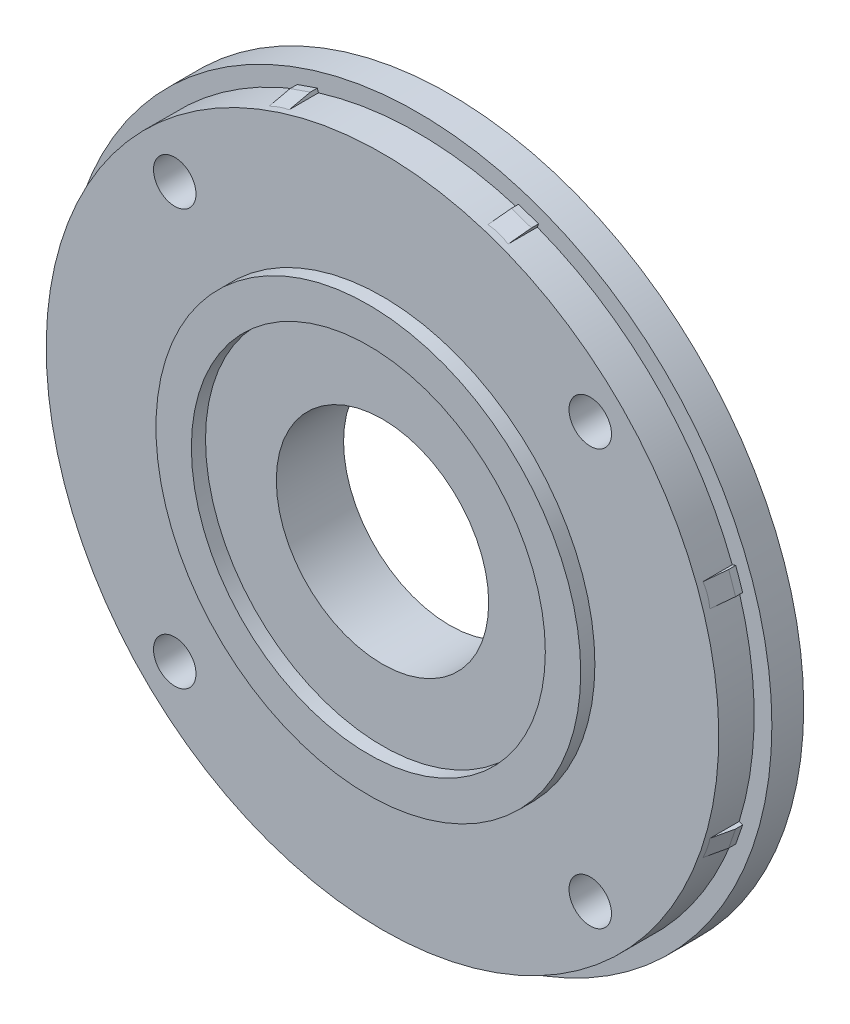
ISO-10303-21;
HEADER;
FILE_DESCRIPTION(('STEP AP214'),'2;1');
FILE_NAME('part.step','',(''),(''),'','','');
FILE_SCHEMA(('AUTOMOTIVE_DESIGN { 1 0 10303 214 1 1 1 1 }'));
ENDSEC;
DATA;
#1=APPLICATION_CONTEXT('core data for automotive mechanical design processes');
#2=APPLICATION_PROTOCOL_DEFINITION('international standard','automotive_design',2000,#1);
#3=PRODUCT_CONTEXT('',#1,'mechanical');
#4=PRODUCT('Part','Part','',(#3));
#5=PRODUCT_RELATED_PRODUCT_CATEGORY('part','',(#4));
#6=PRODUCT_DEFINITION_FORMATION('','',#4);
#7=PRODUCT_DEFINITION_CONTEXT('part definition',#1,'design');
#8=PRODUCT_DEFINITION('design','',#6,#7);
#9=PRODUCT_DEFINITION_SHAPE('','',#8);
#10=(LENGTH_UNIT() NAMED_UNIT(*) SI_UNIT(.MILLI.,.METRE.));
#11=(NAMED_UNIT(*) PLANE_ANGLE_UNIT() SI_UNIT($,.RADIAN.));
#12=(NAMED_UNIT(*) SI_UNIT($,.STERADIAN.) SOLID_ANGLE_UNIT());
#13=UNCERTAINTY_MEASURE_WITH_UNIT(LENGTH_MEASURE(1.E-05),#10,'distance_accuracy_value','');
#14=(GEOMETRIC_REPRESENTATION_CONTEXT(3) GLOBAL_UNCERTAINTY_ASSIGNED_CONTEXT((#13)) GLOBAL_UNIT_ASSIGNED_CONTEXT((#10,
#11,#12)) REPRESENTATION_CONTEXT('',''));
#15=CARTESIAN_POINT('',(0.,0.,0.));
#16=DIRECTION('',(0.,0.,1.));
#17=DIRECTION('',(1.,0.,0.));
#18=AXIS2_PLACEMENT_3D('',#15,#16,#17);
#19=CARTESIAN_POINT('',(14.208993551,45.87324386,-4.));
#20=DIRECTION('',(-0.325568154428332,-0.945518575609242,0.));
#21=DIRECTION('',(0.,0.,-1.));
#22=AXIS2_PLACEMENT_3D('',#19,#20,#21);
#23=PLANE('',#22);
#24=DIRECTION('',(0.,0.,1.));
#25=VECTOR('',#24,1.);
#26=CARTESIAN_POINT('',(14.208993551,45.87324386,-2.9165032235));
#27=LINE('',#26,#25);
#28=CARTESIAN_POINT('',(14.208993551,45.87324386,-5.));
#29=VERTEX_POINT('',#28);
#30=CARTESIAN_POINT('',(14.208993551,45.87324386,-3.99999999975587));
#31=VERTEX_POINT('',#30);
#32=EDGE_CURVE('E338',#29,#31,#27,.T.);
#33=ORIENTED_EDGE('',*,*,#32,.T.);
#34=DIRECTION('',(0.945518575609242,-0.325568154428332,0.));
#35=VECTOR('',#34,1.);
#36=CARTESIAN_POINT('',(15.627271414,45.3848916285,-4.));
#37=LINE('',#36,#35);
#38=CARTESIAN_POINT('',(17.045549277,44.896539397,-3.99999999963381));
#39=VERTEX_POINT('',#38);
#40=EDGE_CURVE('E348',#31,#39,#37,.T.);
#41=ORIENTED_EDGE('',*,*,#40,.T.);
#42=DIRECTION('',(0.,0.,1.));
#43=VECTOR('',#42,1.);
#44=CARTESIAN_POINT('',(17.045549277,44.896539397,-2.9165032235));
#45=LINE('',#44,#43);
#46=CARTESIAN_POINT('',(17.045549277,44.896539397,-5.));
#47=VERTEX_POINT('',#46);
#48=EDGE_CURVE('E345',#47,#39,#45,.T.);
#49=ORIENTED_EDGE('',*,*,#48,.F.);
#50=DIRECTION('',(0.945518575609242,-0.325568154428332,0.));
#51=VECTOR('',#50,1.);
#52=CARTESIAN_POINT('',(14.208993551,45.87324386,-5.));
#53=LINE('',#52,#51);
#54=EDGE_CURVE('E591',#47,#29,#53,.F.);
#55=ORIENTED_EDGE('',*,*,#54,.T.);
#56=EDGE_LOOP('',(#33,#41,#49,#55));
#57=FACE_BOUND('',#56,.T.);
#58=ADVANCED_FACE('F16',(#57),#23,.F.);
#59=CARTESIAN_POINT('',(-14.208993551,45.87324386,-4.));
#60=DIRECTION('',(-0.325568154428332,0.945518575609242,0.));
#61=DIRECTION('',(0.,0.,-1.));
#62=AXIS2_PLACEMENT_3D('',#59,#60,#61);
#63=PLANE('',#62);
#64=DIRECTION('',(-0.945518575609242,-0.325568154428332,0.));
#65=VECTOR('',#64,1.);
#66=CARTESIAN_POINT('',(-15.627271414,45.3848916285,-4.));
#67=LINE('',#66,#65);
#68=CARTESIAN_POINT('',(-14.2089935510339,45.8732438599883,-4.));
#69=VERTEX_POINT('',#68);
#70=CARTESIAN_POINT('',(-17.045549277,44.896539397,-3.99999999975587));
#71=VERTEX_POINT('',#70);
#72=EDGE_CURVE('E330',#69,#71,#67,.T.);
#73=ORIENTED_EDGE('',*,*,#72,.F.);
#74=DIRECTION('',(0.,0.,-1.));
#75=VECTOR('',#74,1.);
#76=CARTESIAN_POINT('',(-14.208993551,45.87324386,-2.9165032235));
#77=LINE('',#76,#75);
#78=CARTESIAN_POINT('',(-14.208993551,45.87324386,-5.));
#79=VERTEX_POINT('',#78);
#80=EDGE_CURVE('E333',#69,#79,#77,.T.);
#81=ORIENTED_EDGE('',*,*,#80,.T.);
#82=DIRECTION('',(-0.945518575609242,-0.325568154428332,0.));
#83=VECTOR('',#82,1.);
#84=CARTESIAN_POINT('',(-14.208993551,45.87324386,-5.));
#85=LINE('',#84,#83);
#86=CARTESIAN_POINT('',(-17.045549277,44.896539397,-5.));
#87=VERTEX_POINT('',#86);
#88=EDGE_CURVE('E580',#79,#87,#85,.T.);
#89=ORIENTED_EDGE('',*,*,#88,.T.);
#90=DIRECTION('',(0.,0.,-1.));
#91=VECTOR('',#90,1.);
#92=CARTESIAN_POINT('',(-17.045549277,44.896539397,-2.9165032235));
#93=LINE('',#92,#91);
#94=EDGE_CURVE('E327',#71,#87,#93,.T.);
#95=ORIENTED_EDGE('',*,*,#94,.F.);
#96=EDGE_LOOP('',(#73,#81,#89,#95));
#97=FACE_BOUND('',#96,.T.);
#98=ADVANCED_FACE('F745',(#97),#63,.T.);
#99=CARTESIAN_POINT('',(-45.87324386,14.208993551,-4.));
#100=DIRECTION('',(0.945518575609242,-0.325568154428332,0.));
#101=DIRECTION('',(0.,0.,-1.));
#102=AXIS2_PLACEMENT_3D('',#99,#100,#101);
#103=PLANE('',#102);
#104=DIRECTION('',(0.,0.,1.));
#105=VECTOR('',#104,1.);
#106=CARTESIAN_POINT('',(-45.87324386,14.208993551,-2.9165032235));
#107=LINE('',#106,#105);
#108=CARTESIAN_POINT('',(-45.87324386,14.208993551,-5.));
#109=VERTEX_POINT('',#108);
#110=CARTESIAN_POINT('',(-45.87324386,14.208993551,-3.99999999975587));
#111=VERTEX_POINT('',#110);
#112=EDGE_CURVE('E315',#109,#111,#107,.T.);
#113=ORIENTED_EDGE('',*,*,#112,.T.);
#114=DIRECTION('',(0.325568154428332,0.945518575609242,0.));
#115=VECTOR('',#114,1.);
#116=CARTESIAN_POINT('',(-45.3848916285,15.627271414,-4.));
#117=LINE('',#116,#115);
#118=CARTESIAN_POINT('',(-44.896539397,17.045549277,-3.99999999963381));
#119=VERTEX_POINT('',#118);
#120=EDGE_CURVE('E326',#111,#119,#117,.T.);
#121=ORIENTED_EDGE('',*,*,#120,.T.);
#122=DIRECTION('',(0.,0.,1.));
#123=VECTOR('',#122,1.);
#124=CARTESIAN_POINT('',(-44.896539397,17.045549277,-2.9165032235));
#125=LINE('',#124,#123);
#126=CARTESIAN_POINT('',(-44.896539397,17.045549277,-5.));
#127=VERTEX_POINT('',#126);
#128=EDGE_CURVE('E322',#127,#119,#125,.T.);
#129=ORIENTED_EDGE('',*,*,#128,.F.);
#130=DIRECTION('',(0.325568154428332,0.945518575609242,0.));
#131=VECTOR('',#130,1.);
#132=CARTESIAN_POINT('',(-45.87324386,14.208993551,-5.));
#133=LINE('',#132,#131);
#134=EDGE_CURVE('E569',#127,#109,#133,.F.);
#135=ORIENTED_EDGE('',*,*,#134,.T.);
#136=EDGE_LOOP('',(#113,#121,#129,#135));
#137=FACE_BOUND('',#136,.T.);
#138=ADVANCED_FACE('F749',(#137),#103,.F.);
#139=CARTESIAN_POINT('',(-45.87324386,-14.208993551,-4.));
#140=DIRECTION('',(-0.945518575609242,-0.325568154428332,0.));
#141=DIRECTION('',(0.,0.,-1.));
#142=AXIS2_PLACEMENT_3D('',#139,#140,#141);
#143=PLANE('',#142);
#144=DIRECTION('',(0.325568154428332,-0.945518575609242,0.));
#145=VECTOR('',#144,1.);
#146=CARTESIAN_POINT('',(-45.3848916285,-15.627271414,-4.));
#147=LINE('',#146,#145);
#148=CARTESIAN_POINT('',(-45.8732438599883,-14.2089935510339,-4.));
#149=VERTEX_POINT('',#148);
#150=CARTESIAN_POINT('',(-44.896539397,-17.045549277,-3.99999999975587));
#151=VERTEX_POINT('',#150);
#152=EDGE_CURVE('E307',#149,#151,#147,.T.);
#153=ORIENTED_EDGE('',*,*,#152,.F.);
#154=DIRECTION('',(0.,0.,-1.));
#155=VECTOR('',#154,1.);
#156=CARTESIAN_POINT('',(-45.87324386,-14.208993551,-2.9165032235));
#157=LINE('',#156,#155);
#158=CARTESIAN_POINT('',(-45.87324386,-14.208993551,-5.));
#159=VERTEX_POINT('',#158);
#160=EDGE_CURVE('E310',#149,#159,#157,.T.);
#161=ORIENTED_EDGE('',*,*,#160,.T.);
#162=DIRECTION('',(0.325568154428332,-0.945518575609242,0.));
#163=VECTOR('',#162,1.);
#164=CARTESIAN_POINT('',(-45.87324386,-14.208993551,-5.));
#165=LINE('',#164,#163);
#166=CARTESIAN_POINT('',(-44.896539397,-17.045549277,-5.));
#167=VERTEX_POINT('',#166);
#168=EDGE_CURVE('E557',#159,#167,#165,.T.);
#169=ORIENTED_EDGE('',*,*,#168,.T.);
#170=DIRECTION('',(0.,0.,-1.));
#171=VECTOR('',#170,1.);
#172=CARTESIAN_POINT('',(-44.896539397,-17.045549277,-2.9165032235));
#173=LINE('',#172,#171);
#174=EDGE_CURVE('E304',#151,#167,#173,.T.);
#175=ORIENTED_EDGE('',*,*,#174,.F.);
#176=EDGE_LOOP('',(#153,#161,#169,#175));
#177=FACE_BOUND('',#176,.T.);
#178=ADVANCED_FACE('F753',(#177),#143,.T.);
#179=CARTESIAN_POINT('',(-14.208993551,-45.87324386,-4.));
#180=DIRECTION('',(0.325568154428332,0.945518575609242,0.));
#181=DIRECTION('',(0.,0.,-1.));
#182=AXIS2_PLACEMENT_3D('',#179,#180,#181);
#183=PLANE('',#182);
#184=DIRECTION('',(0.,0.,1.));
#185=VECTOR('',#184,1.);
#186=CARTESIAN_POINT('',(-14.208993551,-45.87324386,-2.9165032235));
#187=LINE('',#186,#185);
#188=CARTESIAN_POINT('',(-14.208993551,-45.87324386,-5.));
#189=VERTEX_POINT('',#188);
#190=CARTESIAN_POINT('',(-14.208993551,-45.87324386,-3.99999999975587));
#191=VERTEX_POINT('',#190);
#192=EDGE_CURVE('E292',#189,#191,#187,.T.);
#193=ORIENTED_EDGE('',*,*,#192,.T.);
#194=DIRECTION('',(-0.945518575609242,0.325568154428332,0.));
#195=VECTOR('',#194,1.);
#196=CARTESIAN_POINT('',(-15.627271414,-45.3848916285,-4.));
#197=LINE('',#196,#195);
#198=CARTESIAN_POINT('',(-17.045549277,-44.896539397,-3.99999999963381));
#199=VERTEX_POINT('',#198);
#200=EDGE_CURVE('E303',#191,#199,#197,.T.);
#201=ORIENTED_EDGE('',*,*,#200,.T.);
#202=DIRECTION('',(0.,0.,1.));
#203=VECTOR('',#202,1.);
#204=CARTESIAN_POINT('',(-17.045549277,-44.896539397,-2.9165032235));
#205=LINE('',#204,#203);
#206=CARTESIAN_POINT('',(-17.045549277,-44.896539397,-5.));
#207=VERTEX_POINT('',#206);
#208=EDGE_CURVE('E299',#207,#199,#205,.T.);
#209=ORIENTED_EDGE('',*,*,#208,.F.);
#210=DIRECTION('',(-0.945518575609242,0.325568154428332,0.));
#211=VECTOR('',#210,1.);
#212=CARTESIAN_POINT('',(-14.208993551,-45.87324386,-5.));
#213=LINE('',#212,#211);
#214=EDGE_CURVE('E546',#207,#189,#213,.F.);
#215=ORIENTED_EDGE('',*,*,#214,.T.);
#216=EDGE_LOOP('',(#193,#201,#209,#215));
#217=FACE_BOUND('',#216,.T.);
#218=ADVANCED_FACE('F727',(#217),#183,.F.);
#219=CARTESIAN_POINT('',(14.208993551,-45.87324386,-4.));
#220=DIRECTION('',(0.325568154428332,-0.945518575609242,0.));
#221=DIRECTION('',(0.,0.,-1.));
#222=AXIS2_PLACEMENT_3D('',#219,#220,#221);
#223=PLANE('',#222);
#224=DIRECTION('',(0.945518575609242,0.325568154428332,0.));
#225=VECTOR('',#224,1.);
#226=CARTESIAN_POINT('',(15.627271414,-45.3848916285,-4.));
#227=LINE('',#226,#225);
#228=CARTESIAN_POINT('',(14.2089935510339,-45.8732438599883,-4.));
#229=VERTEX_POINT('',#228);
#230=CARTESIAN_POINT('',(17.045549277,-44.896539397,-3.99999999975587));
#231=VERTEX_POINT('',#230);
#232=EDGE_CURVE('E227',#229,#231,#227,.T.);
#233=ORIENTED_EDGE('',*,*,#232,.F.);
#234=DIRECTION('',(0.,0.,-1.));
#235=VECTOR('',#234,1.);
#236=CARTESIAN_POINT('',(14.208993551,-45.87324386,-2.9165032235));
#237=LINE('',#236,#235);
#238=CARTESIAN_POINT('',(14.208993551,-45.87324386,-5.));
#239=VERTEX_POINT('',#238);
#240=EDGE_CURVE('E232',#229,#239,#237,.T.);
#241=ORIENTED_EDGE('',*,*,#240,.T.);
#242=DIRECTION('',(0.945518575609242,0.325568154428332,0.));
#243=VECTOR('',#242,1.);
#244=CARTESIAN_POINT('',(14.208993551,-45.87324386,-5.));
#245=LINE('',#244,#243);
#246=CARTESIAN_POINT('',(17.045549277,-44.896539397,-5.));
#247=VERTEX_POINT('',#246);
#248=EDGE_CURVE('E535',#239,#247,#245,.T.);
#249=ORIENTED_EDGE('',*,*,#248,.T.);
#250=DIRECTION('',(0.,0.,-1.));
#251=VECTOR('',#250,1.);
#252=CARTESIAN_POINT('',(17.045549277,-44.896539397,-2.9165032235));
#253=LINE('',#252,#251);
#254=EDGE_CURVE('E284',#231,#247,#253,.T.);
#255=ORIENTED_EDGE('',*,*,#254,.F.);
#256=EDGE_LOOP('',(#233,#241,#249,#255));
#257=FACE_BOUND('',#256,.T.);
#258=ADVANCED_FACE('F712',(#257),#223,.T.);
#259=CARTESIAN_POINT('',(45.87324386,-14.208993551,-4.));
#260=DIRECTION('',(-0.945518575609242,0.325568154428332,0.));
#261=DIRECTION('',(0.,0.,-1.));
#262=AXIS2_PLACEMENT_3D('',#259,#260,#261);
#263=PLANE('',#262);
#264=DIRECTION('',(0.,0.,1.));
#265=VECTOR('',#264,1.);
#266=CARTESIAN_POINT('',(45.87324386,-14.208993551,-2.9165032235));
#267=LINE('',#266,#265);
#268=CARTESIAN_POINT('',(45.87324386,-14.208993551,-5.));
#269=VERTEX_POINT('',#268);
#270=CARTESIAN_POINT('',(45.87324386,-14.208993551,-3.99999999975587));
#271=VERTEX_POINT('',#270);
#272=EDGE_CURVE('E202',#269,#271,#267,.T.);
#273=ORIENTED_EDGE('',*,*,#272,.T.);
#274=DIRECTION('',(-0.325568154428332,-0.945518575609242,0.));
#275=VECTOR('',#274,1.);
#276=CARTESIAN_POINT('',(45.3848916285,-15.627271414,-4.));
#277=LINE('',#276,#275);
#278=CARTESIAN_POINT('',(44.896539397,-17.045549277,-3.99999999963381));
#279=VERTEX_POINT('',#278);
#280=EDGE_CURVE('E283',#271,#279,#277,.T.);
#281=ORIENTED_EDGE('',*,*,#280,.T.);
#282=DIRECTION('',(0.,0.,1.));
#283=VECTOR('',#282,1.);
#284=CARTESIAN_POINT('',(44.896539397,-17.045549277,-2.9165032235));
#285=LINE('',#284,#283);
#286=CARTESIAN_POINT('',(44.896539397,-17.045549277,-5.));
#287=VERTEX_POINT('',#286);
#288=EDGE_CURVE('E194',#287,#279,#285,.T.);
#289=ORIENTED_EDGE('',*,*,#288,.F.);
#290=DIRECTION('',(-0.325568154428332,-0.945518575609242,0.));
#291=VECTOR('',#290,1.);
#292=CARTESIAN_POINT('',(45.87324386,-14.208993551,-5.));
#293=LINE('',#292,#291);
#294=EDGE_CURVE('E527',#287,#269,#293,.F.);
#295=ORIENTED_EDGE('',*,*,#294,.T.);
#296=EDGE_LOOP('',(#273,#281,#289,#295));
#297=FACE_BOUND('',#296,.T.);
#298=ADVANCED_FACE('F715',(#297),#263,.F.);
#299=CARTESIAN_POINT('',(45.87324386,14.208993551,-4.));
#300=DIRECTION('',(0.945518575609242,0.325568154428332,0.));
#301=DIRECTION('',(0.,0.,-1.));
#302=AXIS2_PLACEMENT_3D('',#299,#300,#301);
#303=PLANE('',#302);
#304=DIRECTION('',(-0.325568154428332,0.945518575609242,0.));
#305=VECTOR('',#304,1.);
#306=CARTESIAN_POINT('',(45.3848916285,15.627271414,-4.));
#307=LINE('',#306,#305);
#308=CARTESIAN_POINT('',(45.8732438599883,14.2089935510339,-4.));
#309=VERTEX_POINT('',#308);
#310=CARTESIAN_POINT('',(44.896539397,17.045549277,-3.99999999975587));
#311=VERTEX_POINT('',#310);
#312=EDGE_CURVE('E352',#309,#311,#307,.T.);
#313=ORIENTED_EDGE('',*,*,#312,.F.);
#314=DIRECTION('',(0.,0.,-1.));
#315=VECTOR('',#314,1.);
#316=CARTESIAN_POINT('',(45.87324386,14.208993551,-2.9165032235));
#317=LINE('',#316,#315);
#318=CARTESIAN_POINT('',(45.87324386,14.208993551,-5.));
#319=VERTEX_POINT('',#318);
#320=EDGE_CURVE('E270',#309,#319,#317,.T.);
#321=ORIENTED_EDGE('',*,*,#320,.T.);
#322=DIRECTION('',(-0.325568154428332,0.945518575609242,0.));
#323=VECTOR('',#322,1.);
#324=CARTESIAN_POINT('',(45.87324386,14.208993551,-5.));
#325=LINE('',#324,#323);
#326=CARTESIAN_POINT('',(44.896539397,17.045549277,-5.));
#327=VERTEX_POINT('',#326);
#328=EDGE_CURVE('E517',#319,#327,#325,.T.);
#329=ORIENTED_EDGE('',*,*,#328,.T.);
#330=DIRECTION('',(0.,0.,-1.));
#331=VECTOR('',#330,1.);
#332=CARTESIAN_POINT('',(44.896539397,17.045549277,-2.9165032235));
#333=LINE('',#332,#331);
#334=EDGE_CURVE('E349',#311,#327,#333,.T.);
#335=ORIENTED_EDGE('',*,*,#334,.F.);
#336=EDGE_LOOP('',(#313,#321,#329,#335));
#337=FACE_BOUND('',#336,.T.);
#338=ADVANCED_FACE('F717',(#337),#303,.T.);
#339=CARTESIAN_POINT('',(0.,0.,0.));
#340=DIRECTION('',(0.,0.,1.));
#341=DIRECTION('',(1.,0.,0.));
#342=AXIS2_PLACEMENT_3D('',#339,#340,#341);
#343=CYLINDRICAL_SURFACE('',#342,25.);
#344=CARTESIAN_POINT('',(0.,0.,0.));
#345=DIRECTION('',(0.,0.,1.));
#346=DIRECTION('',(1.,0.,0.));
#347=AXIS2_PLACEMENT_3D('',#344,#345,#346);
#348=CIRCLE('',#347,25.);
#349=CARTESIAN_POINT('',(25.,0.,0.));
#350=VERTEX_POINT('',#349);
#351=EDGE_CURVE('E20',#350,#350,#348,.F.);
#352=ORIENTED_EDGE('',*,*,#351,.T.);
#353=EDGE_LOOP('',(#352));
#354=FACE_BOUND('',#353,.T.);
#355=CARTESIAN_POINT('',(0.,0.,2.));
#356=DIRECTION('',(0.,0.,1.));
#357=DIRECTION('',(1.,0.,0.));
#358=AXIS2_PLACEMENT_3D('',#355,#356,#357);
#359=CIRCLE('',#358,25.);
#360=CARTESIAN_POINT('',(25.,0.,2.));
#361=VERTEX_POINT('',#360);
#362=EDGE_CURVE('E513',#361,#361,#359,.T.);
#363=ORIENTED_EDGE('',*,*,#362,.T.);
#364=EDGE_LOOP('',(#363));
#365=FACE_BOUND('',#364,.T.);
#366=ADVANCED_FACE('F724',(#354,#365),#343,.F.);
#367=CARTESIAN_POINT('',(25.3,-25.3,0.));
#368=DIRECTION('',(0.,0.,-1.));
#369=DIRECTION('',(-1.,0.,0.));
#370=AXIS2_PLACEMENT_3D('',#367,#368,#369);
#371=PLANE('',#370);
#372=CARTESIAN_POINT('',(0.,0.,0.));
#373=DIRECTION('',(0.,0.,1.));
#374=DIRECTION('',(1.,0.,0.));
#375=AXIS2_PLACEMENT_3D('',#372,#373,#374);
#376=CIRCLE('',#375,15.);
#377=CARTESIAN_POINT('',(15.,0.,0.));
#378=VERTEX_POINT('',#377);
#379=EDGE_CURVE('E269',#378,#378,#376,.T.);
#380=ORIENTED_EDGE('',*,*,#379,.F.);
#381=EDGE_LOOP('',(#380));
#382=FACE_BOUND('',#381,.T.);
#383=ORIENTED_EDGE('',*,*,#351,.F.);
#384=EDGE_LOOP('',(#383));
#385=FACE_BOUND('',#384,.T.);
#386=ADVANCED_FACE('F1214',(#382,#385),#371,.F.);
#387=CARTESIAN_POINT('',(45.378085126,-14.038496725,-5.));
#388=DIRECTION('',(-0.32556815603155,-0.94551857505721,0.));
#389=DIRECTION('',(0.94551857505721,-0.32556815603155,0.));
#390=AXIS2_PLACEMENT_3D('',#387,#388,#389);
#391=PLANE('',#390);
#392=DIRECTION('',(0.,0.,-1.));
#393=VECTOR('',#392,1.);
#394=CARTESIAN_POINT('',(45.3780851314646,-14.0384967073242,-2.5));
#395=LINE('',#394,#393);
#396=CARTESIAN_POINT('',(45.3780851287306,-14.0384967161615,-5.));
#397=VERTEX_POINT('',#396);
#398=CARTESIAN_POINT('',(45.3780851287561,-14.0384967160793,-0.857859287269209));
#399=VERTEX_POINT('',#398);
#400=EDGE_CURVE('E265',#397,#399,#395,.F.);
#401=ORIENTED_EDGE('',*,*,#400,.T.);
#402=DIRECTION('',(0.155442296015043,-0.0535230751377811,-0.986393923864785));
#403=VECTOR('',#402,1.);
#404=CARTESIAN_POINT('',(45.624179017,-14.1232336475,-2.4195032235));
#405=LINE('',#404,#403);
#406=EDGE_CURVE('E277',#399,#271,#405,.T.);
#407=ORIENTED_EDGE('',*,*,#406,.T.);
#408=ORIENTED_EDGE('',*,*,#272,.F.);
#409=DIRECTION('',(0.94551857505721,-0.32556815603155,0.));
#410=VECTOR('',#409,1.);
#411=CARTESIAN_POINT('',(45.378085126,-14.038496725,-5.));
#412=LINE('',#411,#410);
#413=EDGE_CURVE('E523',#269,#397,#412,.F.);
#414=ORIENTED_EDGE('',*,*,#413,.T.);
#415=EDGE_LOOP('',(#401,#407,#408,#414));
#416=FACE_BOUND('',#415,.T.);
#417=ADVANCED_FACE('F1205',(#416),#391,.F.);
#418=CARTESIAN_POINT('',(45.375114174,-14.037473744,-0.839006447));
#419=DIRECTION('',(-0.932653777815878,0.321138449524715,-0.16439898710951));
#420=DIRECTION('',(0.155442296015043,-0.0535230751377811,-0.986393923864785));
#421=AXIS2_PLACEMENT_3D('',#418,#419,#420);
#422=PLANE('',#421);
#423=DIRECTION('',(-0.155442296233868,0.0535230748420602,0.986393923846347));
#424=VECTOR('',#423,1.);
#425=CARTESIAN_POINT('',(44.896539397,-17.045549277,-3.99999999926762));
#426=LINE('',#425,#424);
#427=CARTESIAN_POINT('',(44.401380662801,-16.8750524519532,-0.85785929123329));
#428=VERTEX_POINT('',#427);
#429=EDGE_CURVE('E282',#279,#428,#426,.T.);
#430=ORIENTED_EDGE('',*,*,#429,.F.);
#431=ORIENTED_EDGE('',*,*,#280,.F.);
#432=ORIENTED_EDGE('',*,*,#406,.F.);
#433=CARTESIAN_POINT('',(0.,0.,284.000000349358));
#434=DIRECTION('',(-0.932653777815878,0.321138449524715,-0.16439898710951));
#435=DIRECTION('',(-0.155442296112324,0.0535230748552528,0.986393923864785));
#436=AXIS2_PLACEMENT_3D('',#433,#434,#435);
#437=ELLIPSE('',#436,288.931220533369,47.5);
#438=EDGE_CURVE('E264',#399,#428,#437,.T.);
#439=ORIENTED_EDGE('',*,*,#438,.T.);
#440=EDGE_LOOP('',(#430,#431,#432,#439));
#441=FACE_BOUND('',#440,.T.);
#442=ADVANCED_FACE('F625',(#441),#422,.F.);
#443=CARTESIAN_POINT('',(44.401380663,-16.875052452,-5.));
#444=DIRECTION('',(-0.325568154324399,-0.945518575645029,0.));
#445=DIRECTION('',(0.945518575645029,-0.325568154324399,0.));
#446=AXIS2_PLACEMENT_3D('',#443,#444,#445);
#447=PLANE('',#446);
#448=ORIENTED_EDGE('',*,*,#288,.T.);
#449=ORIENTED_EDGE('',*,*,#429,.T.);
#450=DIRECTION('',(0.,0.,1.));
#451=VECTOR('',#450,1.);
#452=CARTESIAN_POINT('',(44.4013806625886,-16.8750524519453,-2.5));
#453=LINE('',#452,#451);
#454=CARTESIAN_POINT('',(44.4013806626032,-16.8750524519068,-5.));
#455=VERTEX_POINT('',#454);
#456=EDGE_CURVE('E256',#428,#455,#453,.F.);
#457=ORIENTED_EDGE('',*,*,#456,.T.);
#458=DIRECTION('',(0.945518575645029,-0.325568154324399,0.));
#459=VECTOR('',#458,1.);
#460=CARTESIAN_POINT('',(44.401380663,-16.875052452,-5.));
#461=LINE('',#460,#459);
#462=EDGE_CURVE('E530',#455,#287,#461,.T.);
#463=ORIENTED_EDGE('',*,*,#462,.T.);
#464=EDGE_LOOP('',(#448,#449,#457,#463));
#465=FACE_BOUND('',#464,.T.);
#466=ADVANCED_FACE('F620',(#465),#447,.T.);
#467=CARTESIAN_POINT('',(17.045549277,-44.896539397,-5.));
#468=DIRECTION('',(0.945518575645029,0.325568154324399,0.));
#469=DIRECTION('',(-0.325568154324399,0.945518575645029,0.));
#470=AXIS2_PLACEMENT_3D('',#467,#468,#469);
#471=PLANE('',#470);
#472=DIRECTION('',(-0.0535230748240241,0.155442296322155,0.986393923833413));
#473=VECTOR('',#472,1.);
#474=CARTESIAN_POINT('',(16.959789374,-44.6474745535,-2.4195032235));
#475=LINE('',#474,#473);
#476=CARTESIAN_POINT('',(16.8750524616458,-44.4013806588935,-0.857859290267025));
#477=VERTEX_POINT('',#476);
#478=EDGE_CURVE('E221',#231,#477,#475,.T.);
#479=ORIENTED_EDGE('',*,*,#478,.F.);
#480=ORIENTED_EDGE('',*,*,#254,.T.);
#481=DIRECTION('',(-0.325568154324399,0.945518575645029,0.));
#482=VECTOR('',#481,1.);
#483=CARTESIAN_POINT('',(17.045549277,-44.896539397,-5.));
#484=LINE('',#483,#482);
#485=CARTESIAN_POINT('',(16.8750524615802,-44.4013806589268,-5.));
#486=VERTEX_POINT('',#485);
#487=EDGE_CURVE('E248',#247,#486,#484,.T.);
#488=ORIENTED_EDGE('',*,*,#487,.T.);
#489=DIRECTION('',(0.,0.,-1.));
#490=VECTOR('',#489,1.);
#491=CARTESIAN_POINT('',(16.8750524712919,-44.4013806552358,-2.5));
#492=LINE('',#491,#490);
#493=EDGE_CURVE('E239',#486,#477,#492,.F.);
#494=ORIENTED_EDGE('',*,*,#493,.T.);
#495=EDGE_LOOP('',(#479,#480,#488,#494));
#496=FACE_BOUND('',#495,.T.);
#497=ADVANCED_FACE('F246',(#496),#471,.T.);
#498=CARTESIAN_POINT('',(14.037473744,-45.375114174,-0.839006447));
#499=DIRECTION('',(0.321138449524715,-0.932653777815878,0.16439898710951));
#500=DIRECTION('',(0.0535230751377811,-0.155442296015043,-0.986393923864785));
#501=AXIS2_PLACEMENT_3D('',#498,#499,#500);
#502=PLANE('',#501);
#503=ORIENTED_EDGE('',*,*,#232,.T.);
#504=ORIENTED_EDGE('',*,*,#478,.T.);
#505=CARTESIAN_POINT('',(0.,0.,284.000000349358));
#506=DIRECTION('',(0.321138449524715,-0.932653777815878,0.16439898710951));
#507=DIRECTION('',(-0.0535230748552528,0.155442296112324,0.986393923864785));
#508=AXIS2_PLACEMENT_3D('',#505,#506,#507);
#509=ELLIPSE('',#508,288.931220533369,47.5);
#510=CARTESIAN_POINT('',(14.0384967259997,-45.378085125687,-0.857859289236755));
#511=VERTEX_POINT('',#510);
#512=EDGE_CURVE('E225',#477,#511,#509,.F.);
#513=ORIENTED_EDGE('',*,*,#512,.T.);
#514=DIRECTION('',(0.0535230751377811,-0.155442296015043,-0.986393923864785));
#515=VECTOR('',#514,1.);
#516=CARTESIAN_POINT('',(14.0374737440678,-45.3751141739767,-0.839006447));
#517=LINE('',#516,#515);
#518=EDGE_CURVE('E291',#511,#229,#517,.T.);
#519=ORIENTED_EDGE('',*,*,#518,.T.);
#520=EDGE_LOOP('',(#503,#504,#513,#519));
#521=FACE_BOUND('',#520,.T.);
#522=ADVANCED_FACE('F223',(#521),#502,.T.);
#523=CARTESIAN_POINT('',(14.208993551,-45.87324386,-5.));
#524=DIRECTION('',(0.94551857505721,0.32556815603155,0.));
#525=DIRECTION('',(-0.32556815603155,0.94551857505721,0.));
#526=AXIS2_PLACEMENT_3D('',#523,#524,#525);
#527=PLANE('',#526);
#528=DIRECTION('',(0.,0.,1.));
#529=VECTOR('',#528,1.);
#530=CARTESIAN_POINT('',(14.0384967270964,-45.3780851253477,-2.5));
#531=LINE('',#530,#529);
#532=CARTESIAN_POINT('',(14.0384967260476,-45.3780851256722,-5.));
#533=VERTEX_POINT('',#532);
#534=EDGE_CURVE('E243',#511,#533,#531,.F.);
#535=ORIENTED_EDGE('',*,*,#534,.T.);
#536=DIRECTION('',(-0.32556815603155,0.94551857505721,0.));
#537=VECTOR('',#536,1.);
#538=CARTESIAN_POINT('',(14.208993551,-45.87324386,-5.));
#539=LINE('',#538,#537);
#540=EDGE_CURVE('E539',#533,#239,#539,.F.);
#541=ORIENTED_EDGE('',*,*,#540,.T.);
#542=ORIENTED_EDGE('',*,*,#240,.F.);
#543=ORIENTED_EDGE('',*,*,#518,.F.);
#544=EDGE_LOOP('',(#535,#541,#542,#543));
#545=FACE_BOUND('',#544,.T.);
#546=ADVANCED_FACE('F707',(#545),#527,.F.);
#547=CARTESIAN_POINT('',(-14.038496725,-45.378085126,-5.));
#548=DIRECTION('',(-0.94551857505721,0.32556815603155,0.));
#549=DIRECTION('',(-0.32556815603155,-0.94551857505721,0.));
#550=AXIS2_PLACEMENT_3D('',#547,#548,#549);
#551=PLANE('',#550);
#552=DIRECTION('',(0.,0.,-1.));
#553=VECTOR('',#552,1.);
#554=CARTESIAN_POINT('',(-14.0384967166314,-45.3780851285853,-2.5));
#555=LINE('',#554,#553);
#556=CARTESIAN_POINT('',(-14.0384967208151,-45.378085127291,-5.));
#557=VERTEX_POINT('',#556);
#558=CARTESIAN_POINT('',(-14.0384967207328,-45.3780851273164,-0.857859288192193));
#559=VERTEX_POINT('',#558);
#560=EDGE_CURVE('E498',#557,#559,#555,.F.);
#561=ORIENTED_EDGE('',*,*,#560,.T.);
#562=DIRECTION('',(-0.0535230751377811,-0.155442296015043,-0.986393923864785));
#563=VECTOR('',#562,1.);
#564=CARTESIAN_POINT('',(-14.1232336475,-45.624179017,-2.4195032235));
#565=LINE('',#564,#563);
#566=EDGE_CURVE('E296',#559,#191,#565,.T.);
#567=ORIENTED_EDGE('',*,*,#566,.T.);
#568=ORIENTED_EDGE('',*,*,#192,.F.);
#569=DIRECTION('',(-0.32556815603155,-0.94551857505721,0.));
#570=VECTOR('',#569,1.);
#571=CARTESIAN_POINT('',(-14.038496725,-45.378085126,-5.));
#572=LINE('',#571,#570);
#573=EDGE_CURVE('E543',#189,#557,#572,.F.);
#574=ORIENTED_EDGE('',*,*,#573,.T.);
#575=EDGE_LOOP('',(#561,#567,#568,#574));
#576=FACE_BOUND('',#575,.T.);
#577=ADVANCED_FACE('F698',(#576),#551,.F.);
#578=CARTESIAN_POINT('',(-14.037473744,-45.375114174,-0.839006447));
#579=DIRECTION('',(0.321138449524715,0.932653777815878,-0.16439898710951));
#580=DIRECTION('',(-0.0535230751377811,-0.155442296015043,-0.986393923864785));
#581=AXIS2_PLACEMENT_3D('',#578,#579,#580);
#582=PLANE('',#581);
#583=DIRECTION('',(0.0535230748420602,0.155442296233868,0.986393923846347));
#584=VECTOR('',#583,1.);
#585=CARTESIAN_POINT('',(-17.045549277,-44.896539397,-3.99999999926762));
#586=LINE('',#585,#584);
#587=CARTESIAN_POINT('',(-16.8750524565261,-44.4013806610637,-0.857859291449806));
#588=VERTEX_POINT('',#587);
#589=EDGE_CURVE('E302',#199,#588,#586,.T.);
#590=ORIENTED_EDGE('',*,*,#589,.F.);
#591=ORIENTED_EDGE('',*,*,#200,.F.);
#592=ORIENTED_EDGE('',*,*,#566,.F.);
#593=CARTESIAN_POINT('',(0.,0.,284.000000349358));
#594=DIRECTION('',(0.321138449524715,0.932653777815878,-0.16439898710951));
#595=DIRECTION('',(0.0535230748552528,0.155442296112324,0.986393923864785));
#596=AXIS2_PLACEMENT_3D('',#593,#594,#595);
#597=ELLIPSE('',#596,288.931220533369,47.5);
#598=EDGE_CURVE('E494',#559,#588,#597,.T.);
#599=ORIENTED_EDGE('',*,*,#598,.T.);
#600=EDGE_LOOP('',(#590,#591,#592,#599));
#601=FACE_BOUND('',#600,.T.);
#602=ADVANCED_FACE('F765',(#601),#582,.F.);
#603=CARTESIAN_POINT('',(-16.875052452,-44.401380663,-5.));
#604=DIRECTION('',(-0.945518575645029,0.325568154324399,0.));
#605=DIRECTION('',(-0.325568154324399,-0.945518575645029,0.));
#606=AXIS2_PLACEMENT_3D('',#603,#604,#605);
#607=PLANE('',#606);
#608=ORIENTED_EDGE('',*,*,#208,.T.);
#609=ORIENTED_EDGE('',*,*,#589,.T.);
#610=DIRECTION('',(0.,0.,1.));
#611=VECTOR('',#610,1.);
#612=CARTESIAN_POINT('',(-16.8750524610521,-44.4013806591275,-2.5));
#613=LINE('',#612,#611);
#614=CARTESIAN_POINT('',(-16.8750524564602,-44.4013806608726,-5.));
#615=VERTEX_POINT('',#614);
#616=EDGE_CURVE('E493',#588,#615,#613,.F.);
#617=ORIENTED_EDGE('',*,*,#616,.T.);
#618=DIRECTION('',(-0.325568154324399,-0.945518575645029,0.));
#619=VECTOR('',#618,1.);
#620=CARTESIAN_POINT('',(-16.875052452,-44.401380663,-5.));
#621=LINE('',#620,#619);
#622=EDGE_CURVE('E550',#615,#207,#621,.T.);
#623=ORIENTED_EDGE('',*,*,#622,.T.);
#624=EDGE_LOOP('',(#608,#609,#617,#623));
#625=FACE_BOUND('',#624,.T.);
#626=ADVANCED_FACE('F767',(#625),#607,.T.);
#627=CARTESIAN_POINT('',(-44.896539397,-17.045549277,-5.));
#628=DIRECTION('',(0.325568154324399,-0.945518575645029,0.));
#629=DIRECTION('',(0.945518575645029,0.325568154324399,0.));
#630=AXIS2_PLACEMENT_3D('',#627,#628,#629);
#631=PLANE('',#630);
#632=DIRECTION('',(0.155442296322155,0.0535230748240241,0.986393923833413));
#633=VECTOR('',#632,1.);
#634=CARTESIAN_POINT('',(-44.6474745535,-16.959789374,-2.4195032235));
#635=LINE('',#634,#633);
#636=CARTESIAN_POINT('',(-44.401380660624,-16.8750524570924,-0.857859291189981));
#637=VERTEX_POINT('',#636);
#638=EDGE_CURVE('E314',#151,#637,#635,.T.);
#639=ORIENTED_EDGE('',*,*,#638,.F.);
#640=ORIENTED_EDGE('',*,*,#174,.T.);
#641=DIRECTION('',(0.945518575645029,0.325568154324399,0.));
#642=VECTOR('',#641,1.);
#643=CARTESIAN_POINT('',(-44.896539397,-17.045549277,-5.));
#644=LINE('',#643,#642);
#645=CARTESIAN_POINT('',(-44.4013806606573,-16.8750524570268,-5.));
#646=VERTEX_POINT('',#645);
#647=EDGE_CURVE('E554',#167,#646,#644,.T.);
#648=ORIENTED_EDGE('',*,*,#647,.T.);
#649=DIRECTION('',(0.,0.,-1.));
#650=VECTOR('',#649,1.);
#651=CARTESIAN_POINT('',(-44.4013806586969,-16.8750524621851,-2.5));
#652=LINE('',#651,#650);
#653=EDGE_CURVE('E488',#646,#637,#652,.F.);
#654=ORIENTED_EDGE('',*,*,#653,.T.);
#655=EDGE_LOOP('',(#639,#640,#648,#654));
#656=FACE_BOUND('',#655,.T.);
#657=ADVANCED_FACE('F838',(#656),#631,.T.);
#658=CARTESIAN_POINT('',(-45.375114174,-14.037473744,-0.839006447));
#659=DIRECTION('',(-0.932653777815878,-0.321138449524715,0.16439898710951));
#660=DIRECTION('',(-0.155442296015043,-0.0535230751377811,-0.986393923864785));
#661=AXIS2_PLACEMENT_3D('',#658,#659,#660);
#662=PLANE('',#661);
#663=ORIENTED_EDGE('',*,*,#152,.T.);
#664=ORIENTED_EDGE('',*,*,#638,.T.);
#665=CARTESIAN_POINT('',(0.,0.,284.000000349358));
#666=DIRECTION('',(-0.932653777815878,-0.321138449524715,0.16439898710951));
#667=DIRECTION('',(0.155442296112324,0.0535230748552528,0.986393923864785));
#668=AXIS2_PLACEMENT_3D('',#665,#666,#667);
#669=ELLIPSE('',#668,288.931220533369,47.5);
#670=CARTESIAN_POINT('',(-45.3780851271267,-14.0384967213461,-0.857859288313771));
#671=VERTEX_POINT('',#670);
#672=EDGE_CURVE('E483',#637,#671,#669,.F.);
#673=ORIENTED_EDGE('',*,*,#672,.T.);
#674=DIRECTION('',(-0.155442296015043,-0.0535230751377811,-0.986393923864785));
#675=VECTOR('',#674,1.);
#676=CARTESIAN_POINT('',(-45.3751141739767,-14.0374737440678,-0.839006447));
#677=LINE('',#676,#675);
#678=EDGE_CURVE('E313',#671,#149,#677,.T.);
#679=ORIENTED_EDGE('',*,*,#678,.T.);
#680=EDGE_LOOP('',(#663,#664,#673,#679));
#681=FACE_BOUND('',#680,.T.);
#682=ADVANCED_FACE('F837',(#681),#662,.T.);
#683=CARTESIAN_POINT('',(-45.87324386,-14.208993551,-5.));
#684=DIRECTION('',(0.32556815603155,-0.94551857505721,0.));
#685=DIRECTION('',(0.94551857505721,0.32556815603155,0.));
#686=AXIS2_PLACEMENT_3D('',#683,#684,#685);
#687=PLANE('',#686);
#688=DIRECTION('',(0.,0.,1.));
#689=VECTOR('',#688,1.);
#690=CARTESIAN_POINT('',(-45.378085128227,-14.0384967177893,-2.5));
#691=LINE('',#690,#689);
#692=CARTESIAN_POINT('',(-45.3780851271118,-14.0384967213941,-5.));
#693=VERTEX_POINT('',#692);
#694=EDGE_CURVE('E487',#671,#693,#691,.F.);
#695=ORIENTED_EDGE('',*,*,#694,.T.);
#696=DIRECTION('',(0.94551857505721,0.32556815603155,0.));
#697=VECTOR('',#696,1.);
#698=CARTESIAN_POINT('',(-45.87324386,-14.208993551,-5.));
#699=LINE('',#698,#697);
#700=EDGE_CURVE('E561',#693,#159,#699,.F.);
#701=ORIENTED_EDGE('',*,*,#700,.T.);
#702=ORIENTED_EDGE('',*,*,#160,.F.);
#703=ORIENTED_EDGE('',*,*,#678,.F.);
#704=EDGE_LOOP('',(#695,#701,#702,#703));
#705=FACE_BOUND('',#704,.T.);
#706=ADVANCED_FACE('F779',(#705),#687,.F.);
#707=CARTESIAN_POINT('',(-45.378085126,14.038496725,-5.));
#708=DIRECTION('',(0.32556815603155,0.94551857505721,0.));
#709=DIRECTION('',(-0.94551857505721,0.32556815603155,0.));
#710=AXIS2_PLACEMENT_3D('',#707,#708,#709);
#711=PLANE('',#710);
#712=DIRECTION('',(0.,0.,-1.));
#713=VECTOR('',#712,1.);
#714=CARTESIAN_POINT('',(-45.3780851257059,14.0384967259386,-2.5));
#715=LINE('',#714,#713);
#716=CARTESIAN_POINT('',(-45.3780851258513,14.0384967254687,-5.));
#717=VERTEX_POINT('',#716);
#718=CARTESIAN_POINT('',(-45.3780851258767,14.0384967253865,-0.857859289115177));
#719=VERTEX_POINT('',#718);
#720=EDGE_CURVE('E482',#717,#719,#715,.F.);
#721=ORIENTED_EDGE('',*,*,#720,.T.);
#722=DIRECTION('',(-0.155442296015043,0.0535230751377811,-0.986393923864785));
#723=VECTOR('',#722,1.);
#724=CARTESIAN_POINT('',(-45.624179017,14.1232336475,-2.4195032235));
#725=LINE('',#724,#723);
#726=EDGE_CURVE('E319',#719,#111,#725,.T.);
#727=ORIENTED_EDGE('',*,*,#726,.T.);
#728=ORIENTED_EDGE('',*,*,#112,.F.);
#729=DIRECTION('',(-0.94551857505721,0.32556815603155,0.));
#730=VECTOR('',#729,1.);
#731=CARTESIAN_POINT('',(-45.378085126,14.038496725,-5.));
#732=LINE('',#731,#730);
#733=EDGE_CURVE('E565',#109,#717,#732,.F.);
#734=ORIENTED_EDGE('',*,*,#733,.T.);
#735=EDGE_LOOP('',(#721,#727,#728,#734));
#736=FACE_BOUND('',#735,.T.);
#737=ADVANCED_FACE('F786',(#736),#711,.F.);
#738=CARTESIAN_POINT('',(-45.375114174,14.037473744,-0.839006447));
#739=DIRECTION('',(0.932653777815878,-0.321138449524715,-0.16439898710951));
#740=DIRECTION('',(-0.155442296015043,0.0535230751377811,-0.986393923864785));
#741=AXIS2_PLACEMENT_3D('',#738,#739,#740);
#742=PLANE('',#741);
#743=DIRECTION('',(0.155442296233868,-0.0535230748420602,0.986393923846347));
#744=VECTOR('',#743,1.);
#745=CARTESIAN_POINT('',(-44.896539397,17.045549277,-3.99999999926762));
#746=LINE('',#745,#744);
#747=CARTESIAN_POINT('',(-44.4013806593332,16.8750524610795,-0.85785929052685));
#748=VERTEX_POINT('',#747);
#749=EDGE_CURVE('E325',#119,#748,#746,.T.);
#750=ORIENTED_EDGE('',*,*,#749,.F.);
#751=ORIENTED_EDGE('',*,*,#120,.F.);
#752=ORIENTED_EDGE('',*,*,#726,.F.);
#753=CARTESIAN_POINT('',(0.,0.,284.000000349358));
#754=DIRECTION('',(0.932653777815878,-0.321138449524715,-0.16439898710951));
#755=DIRECTION('',(0.155442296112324,-0.0535230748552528,0.986393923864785));
#756=AXIS2_PLACEMENT_3D('',#753,#754,#755);
#757=ELLIPSE('',#756,288.931220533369,47.5);
#758=EDGE_CURVE('E478',#719,#748,#757,.T.);
#759=ORIENTED_EDGE('',*,*,#758,.T.);
#760=EDGE_LOOP('',(#750,#751,#752,#759));
#761=FACE_BOUND('',#760,.T.);
#762=ADVANCED_FACE('F791',(#761),#742,.F.);
#763=CARTESIAN_POINT('',(-44.401380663,16.875052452,-5.));
#764=DIRECTION('',(0.325568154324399,0.945518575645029,0.));
#765=DIRECTION('',(-0.945518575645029,0.325568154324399,0.));
#766=AXIS2_PLACEMENT_3D('',#763,#764,#765);
#767=PLANE('',#766);
#768=ORIENTED_EDGE('',*,*,#128,.T.);
#769=ORIENTED_EDGE('',*,*,#749,.T.);
#770=DIRECTION('',(0.,0.,1.));
#771=VECTOR('',#770,1.);
#772=CARTESIAN_POINT('',(-44.4013806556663,16.8750524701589,-2.5));
#773=LINE('',#772,#771);
#774=CARTESIAN_POINT('',(-44.4013806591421,16.8750524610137,-5.));
#775=VERTEX_POINT('',#774);
#776=EDGE_CURVE('E477',#748,#775,#773,.F.);
#777=ORIENTED_EDGE('',*,*,#776,.T.);
#778=DIRECTION('',(-0.945518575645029,0.325568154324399,0.));
#779=VECTOR('',#778,1.);
#780=CARTESIAN_POINT('',(-44.401380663,16.875052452,-5.));
#781=LINE('',#780,#779);
#782=EDGE_CURVE('E573',#775,#127,#781,.T.);
#783=ORIENTED_EDGE('',*,*,#782,.T.);
#784=EDGE_LOOP('',(#768,#769,#777,#783));
#785=FACE_BOUND('',#784,.T.);
#786=ADVANCED_FACE('F793',(#785),#767,.T.);
#787=CARTESIAN_POINT('',(-17.045549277,44.896539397,-5.));
#788=DIRECTION('',(-0.945518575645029,-0.325568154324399,0.));
#789=DIRECTION('',(0.325568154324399,-0.945518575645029,0.));
#790=AXIS2_PLACEMENT_3D('',#787,#788,#789);
#791=PLANE('',#790);
#792=DIRECTION('',(0.0535230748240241,-0.155442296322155,0.986393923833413));
#793=VECTOR('',#792,1.);
#794=CARTESIAN_POINT('',(-16.959789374,44.6474745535,-2.4195032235));
#795=LINE('',#794,#793);
#796=CARTESIAN_POINT('',(-16.875052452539,44.4013806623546,-0.857859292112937));
#797=VERTEX_POINT('',#796);
#798=EDGE_CURVE('E337',#71,#797,#795,.T.);
#799=ORIENTED_EDGE('',*,*,#798,.F.);
#800=ORIENTED_EDGE('',*,*,#94,.T.);
#801=DIRECTION('',(0.325568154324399,-0.945518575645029,0.));
#802=VECTOR('',#801,1.);
#803=CARTESIAN_POINT('',(-17.045549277,44.896539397,-5.));
#804=LINE('',#803,#802);
#805=CARTESIAN_POINT('',(-16.8750524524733,44.4013806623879,-5.));
#806=VERTEX_POINT('',#805);
#807=EDGE_CURVE('E577',#87,#806,#804,.T.);
#808=ORIENTED_EDGE('',*,*,#807,.T.);
#809=DIRECTION('',(0.,0.,-1.));
#810=VECTOR('',#809,1.);
#811=CARTESIAN_POINT('',(-16.8750524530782,44.401380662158,-2.5));
#812=LINE('',#811,#810);
#813=EDGE_CURVE('E472',#806,#797,#812,.F.);
#814=ORIENTED_EDGE('',*,*,#813,.T.);
#815=EDGE_LOOP('',(#799,#800,#808,#814));
#816=FACE_BOUND('',#815,.T.);
#817=ADVANCED_FACE('F857',(#816),#791,.T.);
#818=CARTESIAN_POINT('',(-14.037473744,45.375114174,-0.839006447));
#819=DIRECTION('',(-0.321138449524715,0.932653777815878,0.16439898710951));
#820=DIRECTION('',(-0.0535230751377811,0.155442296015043,-0.986393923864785));
#821=AXIS2_PLACEMENT_3D('',#818,#819,#820);
#822=PLANE('',#821);
#823=ORIENTED_EDGE('',*,*,#72,.T.);
#824=ORIENTED_EDGE('',*,*,#798,.T.);
#825=CARTESIAN_POINT('',(0.,0.,284.000000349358));
#826=DIRECTION('',(-0.321138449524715,0.932653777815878,0.16439898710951));
#827=DIRECTION('',(0.0535230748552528,-0.155442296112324,0.986393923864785));
#828=AXIS2_PLACEMENT_3D('',#825,#826,#827);
#829=ELLIPSE('',#828,288.931220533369,47.5);
#830=CARTESIAN_POINT('',(-14.0384967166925,45.3780851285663,-0.857859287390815));
#831=VERTEX_POINT('',#830);
#832=EDGE_CURVE('E468',#797,#831,#829,.F.);
#833=ORIENTED_EDGE('',*,*,#832,.T.);
#834=DIRECTION('',(-0.0535230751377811,0.155442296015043,-0.986393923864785));
#835=VECTOR('',#834,1.);
#836=CARTESIAN_POINT('',(-14.0374737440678,45.3751141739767,-0.839006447));
#837=LINE('',#836,#835);
#838=EDGE_CURVE('E336',#831,#69,#837,.T.);
#839=ORIENTED_EDGE('',*,*,#838,.T.);
#840=EDGE_LOOP('',(#823,#824,#833,#839));
#841=FACE_BOUND('',#840,.T.);
#842=ADVANCED_FACE('F860',(#841),#822,.T.);
#843=CARTESIAN_POINT('',(-14.208993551,45.87324386,-5.));
#844=DIRECTION('',(-0.94551857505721,-0.32556815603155,0.));
#845=DIRECTION('',(0.32556815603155,-0.94551857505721,0.));
#846=AXIS2_PLACEMENT_3D('',#843,#844,#845);
#847=PLANE('',#846);
#848=DIRECTION('',(0.,0.,1.));
#849=VECTOR('',#848,1.);
#850=CARTESIAN_POINT('',(-14.0384967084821,45.3780851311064,-2.5));
#851=LINE('',#850,#849);
#852=CARTESIAN_POINT('',(-14.0384967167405,45.3780851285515,-5.));
#853=VERTEX_POINT('',#852);
#854=EDGE_CURVE('E467',#831,#853,#851,.F.);
#855=ORIENTED_EDGE('',*,*,#854,.T.);
#856=DIRECTION('',(0.32556815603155,-0.94551857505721,0.));
#857=VECTOR('',#856,1.);
#858=CARTESIAN_POINT('',(-14.208993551,45.87324386,-5.));
#859=LINE('',#858,#857);
#860=EDGE_CURVE('E584',#853,#79,#859,.F.);
#861=ORIENTED_EDGE('',*,*,#860,.T.);
#862=ORIENTED_EDGE('',*,*,#80,.F.);
#863=ORIENTED_EDGE('',*,*,#838,.F.);
#864=EDGE_LOOP('',(#855,#861,#862,#863));
#865=FACE_BOUND('',#864,.T.);
#866=ADVANCED_FACE('F804',(#865),#847,.F.);
#867=CARTESIAN_POINT('',(14.038496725,45.378085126,-5.));
#868=DIRECTION('',(0.94551857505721,-0.32556815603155,0.));
#869=DIRECTION('',(0.32556815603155,0.94551857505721,0.));
#870=AXIS2_PLACEMENT_3D('',#867,#868,#869);
#871=PLANE('',#870);
#872=DIRECTION('',(0.,0.,-1.));
#873=VECTOR('',#872,1.);
#874=CARTESIAN_POINT('',(14.0384967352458,45.3780851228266,-2.5));
#875=LINE('',#874,#873);
#876=CARTESIAN_POINT('',(14.0384967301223,45.3780851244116,-5.));
#877=VERTEX_POINT('',#876);
#878=CARTESIAN_POINT('',(14.0384967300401,45.3780851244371,-0.857859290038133));
#879=VERTEX_POINT('',#878);
#880=EDGE_CURVE('E462',#877,#879,#875,.F.);
#881=ORIENTED_EDGE('',*,*,#880,.T.);
#882=DIRECTION('',(0.0535230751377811,0.155442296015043,-0.986393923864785));
#883=VECTOR('',#882,1.);
#884=CARTESIAN_POINT('',(14.1232336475,45.624179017,-2.4195032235));
#885=LINE('',#884,#883);
#886=EDGE_CURVE('E342',#879,#31,#885,.T.);
#887=ORIENTED_EDGE('',*,*,#886,.T.);
#888=ORIENTED_EDGE('',*,*,#32,.F.);
#889=DIRECTION('',(0.32556815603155,0.94551857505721,0.));
#890=VECTOR('',#889,1.);
#891=CARTESIAN_POINT('',(14.038496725,45.378085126,-5.));
#892=LINE('',#891,#890);
#893=EDGE_CURVE('E588',#29,#877,#892,.F.);
#894=ORIENTED_EDGE('',*,*,#893,.T.);
#895=EDGE_LOOP('',(#881,#887,#888,#894));
#896=FACE_BOUND('',#895,.T.);
#897=ADVANCED_FACE('F812',(#896),#871,.F.);
#898=CARTESIAN_POINT('',(14.037473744,45.375114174,-0.839006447));
#899=DIRECTION('',(-0.321138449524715,-0.932653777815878,-0.16439898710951));
#900=DIRECTION('',(0.0535230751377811,0.155442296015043,-0.986393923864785));
#901=AXIS2_PLACEMENT_3D('',#898,#899,#900);
#902=PLANE('',#901);
#903=DIRECTION('',(-0.0535230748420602,-0.155442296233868,0.986393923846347));
#904=VECTOR('',#903,1.);
#905=CARTESIAN_POINT('',(17.045549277,44.896539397,-3.99999999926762));
#906=LINE('',#905,#904);
#907=CARTESIAN_POINT('',(16.8750524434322,44.4013806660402,-0.857859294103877));
#908=VERTEX_POINT('',#907);
#909=EDGE_CURVE('E347',#39,#908,#906,.T.);
#910=ORIENTED_EDGE('',*,*,#909,.F.);
#911=ORIENTED_EDGE('',*,*,#40,.F.);
#912=ORIENTED_EDGE('',*,*,#886,.F.);
#913=CARTESIAN_POINT('',(0.,0.,284.000000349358));
#914=DIRECTION('',(-0.321138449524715,-0.932653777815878,-0.16439898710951));
#915=DIRECTION('',(-0.0535230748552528,-0.155442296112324,0.986393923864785));
#916=AXIS2_PLACEMENT_3D('',#913,#914,#915);
#917=ELLIPSE('',#916,288.931220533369,47.5);
#918=EDGE_CURVE('E458',#879,#908,#917,.T.);
#919=ORIENTED_EDGE('',*,*,#918,.T.);
#920=EDGE_LOOP('',(#910,#911,#912,#919));
#921=FACE_BOUND('',#920,.T.);
#922=ADVANCED_FACE('F868',(#921),#902,.F.);
#923=CARTESIAN_POINT('',(16.875052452,44.401380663,-5.));
#924=DIRECTION('',(0.945518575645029,-0.325568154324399,0.));
#925=DIRECTION('',(0.325568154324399,0.945518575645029,0.));
#926=AXIS2_PLACEMENT_3D('',#923,#924,#925);
#927=PLANE('',#926);
#928=ORIENTED_EDGE('',*,*,#48,.T.);
#929=ORIENTED_EDGE('',*,*,#909,.T.);
#930=DIRECTION('',(0.,0.,1.));
#931=VECTOR('',#930,1.);
#932=CARTESIAN_POINT('',(16.8750524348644,44.4013806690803,-2.5));
#933=LINE('',#932,#931);
#934=CARTESIAN_POINT('',(16.8750524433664,44.401380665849,-5.));
#935=VERTEX_POINT('',#934);
#936=EDGE_CURVE('E457',#908,#935,#933,.F.);
#937=ORIENTED_EDGE('',*,*,#936,.T.);
#938=DIRECTION('',(0.325568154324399,0.945518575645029,0.));
#939=VECTOR('',#938,1.);
#940=CARTESIAN_POINT('',(16.875052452,44.401380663,-5.));
#941=LINE('',#940,#939);
#942=EDGE_CURVE('E595',#935,#47,#941,.T.);
#943=ORIENTED_EDGE('',*,*,#942,.T.);
#944=EDGE_LOOP('',(#928,#929,#937,#943));
#945=FACE_BOUND('',#944,.T.);
#946=ADVANCED_FACE('F817',(#945),#927,.T.);
#947=CARTESIAN_POINT('',(44.896539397,17.045549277,-5.));
#948=DIRECTION('',(-0.325568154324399,0.945518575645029,0.));
#949=DIRECTION('',(-0.945518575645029,-0.325568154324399,0.));
#950=AXIS2_PLACEMENT_3D('',#947,#948,#949);
#951=PLANE('',#950);
#952=DIRECTION('',(-0.155442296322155,-0.0535230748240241,0.986393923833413));
#953=VECTOR('',#952,1.);
#954=CARTESIAN_POINT('',(44.6474745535,16.959789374,-2.4195032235));
#955=LINE('',#954,#953);
#956=CARTESIAN_POINT('',(44.4013806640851,16.8750524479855,-0.857859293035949));
#957=VERTEX_POINT('',#956);
#958=EDGE_CURVE('E274',#311,#957,#955,.T.);
#959=ORIENTED_EDGE('',*,*,#958,.F.);
#960=ORIENTED_EDGE('',*,*,#334,.T.);
#961=DIRECTION('',(-0.945518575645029,-0.325568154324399,0.));
#962=VECTOR('',#961,1.);
#963=CARTESIAN_POINT('',(44.896539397,17.045549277,-5.));
#964=LINE('',#963,#962);
#965=CARTESIAN_POINT('',(44.4013806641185,16.8750524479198,-5.));
#966=VERTEX_POINT('',#965);
#967=EDGE_CURVE('E599',#327,#966,#964,.T.);
#968=ORIENTED_EDGE('',*,*,#967,.T.);
#969=DIRECTION('',(0.,0.,-1.));
#970=VECTOR('',#969,1.);
#971=CARTESIAN_POINT('',(44.4013806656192,16.8750524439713,-2.5));
#972=LINE('',#971,#970);
#973=EDGE_CURVE('E452',#966,#957,#972,.F.);
#974=ORIENTED_EDGE('',*,*,#973,.T.);
#975=EDGE_LOOP('',(#959,#960,#968,#974));
#976=FACE_BOUND('',#975,.T.);
#977=ADVANCED_FACE('F825',(#976),#951,.T.);
#978=CARTESIAN_POINT('',(45.375114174,14.037473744,-0.839006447));
#979=DIRECTION('',(0.932653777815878,0.321138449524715,0.16439898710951));
#980=DIRECTION('',(0.155442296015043,0.0535230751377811,-0.986393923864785));
#981=AXIS2_PLACEMENT_3D('',#978,#979,#980);
#982=PLANE('',#981);
#983=ORIENTED_EDGE('',*,*,#312,.T.);
#984=ORIENTED_EDGE('',*,*,#958,.T.);
#985=CARTESIAN_POINT('',(0.,0.,284.000000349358));
#986=DIRECTION('',(0.932653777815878,0.321138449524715,0.16439898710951));
#987=DIRECTION('',(-0.155442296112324,-0.0535230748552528,0.986393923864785));
#988=AXIS2_PLACEMENT_3D('',#985,#986,#987);
#989=ELLIPSE('',#988,288.931220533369,47.5);
#990=CARTESIAN_POINT('',(45.3780851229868,14.0384967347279,-0.857859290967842));
#991=VERTEX_POINT('',#990);
#992=EDGE_CURVE('E448',#957,#991,#989,.F.);
#993=ORIENTED_EDGE('',*,*,#992,.T.);
#994=DIRECTION('',(0.155442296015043,0.0535230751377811,-0.986393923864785));
#995=VECTOR('',#994,1.);
#996=CARTESIAN_POINT('',(45.3751141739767,14.0374737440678,-0.839006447));
#997=LINE('',#996,#995);
#998=EDGE_CURVE('E273',#991,#309,#997,.T.);
#999=ORIENTED_EDGE('',*,*,#998,.T.);
#1000=EDGE_LOOP('',(#983,#984,#993,#999));
#1001=FACE_BOUND('',#1000,.T.);
#1002=ADVANCED_FACE('F831',(#1001),#982,.T.);
#1003=CARTESIAN_POINT('',(45.87324386,14.208993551,-5.));
#1004=DIRECTION('',(-0.32556815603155,0.94551857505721,0.));
#1005=DIRECTION('',(-0.94551857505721,-0.32556815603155,0.));
#1006=AXIS2_PLACEMENT_3D('',#1003,#1004,#1005);
#1007=PLANE('',#1006);
#1008=DIRECTION('',(0.,0.,1.));
#1009=VECTOR('',#1008,1.);
#1010=CARTESIAN_POINT('',(45.3780851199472,14.038496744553,-2.5));
#1011=LINE('',#1010,#1009);
#1012=CARTESIAN_POINT('',(45.3780851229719,14.0384967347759,-5.));
#1013=VERTEX_POINT('',#1012);
#1014=EDGE_CURVE('E447',#991,#1013,#1011,.F.);
#1015=ORIENTED_EDGE('',*,*,#1014,.T.);
#1016=DIRECTION('',(-0.94551857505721,-0.32556815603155,0.));
#1017=VECTOR('',#1016,1.);
#1018=CARTESIAN_POINT('',(45.87324386,14.208993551,-5.));
#1019=LINE('',#1018,#1017);
#1020=EDGE_CURVE('E36',#1013,#319,#1019,.F.);
#1021=ORIENTED_EDGE('',*,*,#1020,.T.);
#1022=ORIENTED_EDGE('',*,*,#320,.F.);
#1023=ORIENTED_EDGE('',*,*,#998,.F.);
#1024=EDGE_LOOP('',(#1015,#1021,#1022,#1023));
#1025=FACE_BOUND('',#1024,.T.);
#1026=ADVANCED_FACE('F829',(#1025),#1007,.F.);
#1027=CARTESIAN_POINT('',(50.6,-50.6,-5.));
#1028=DIRECTION('',(0.,0.,-1.));
#1029=DIRECTION('',(-1.,0.,0.));
#1030=AXIS2_PLACEMENT_3D('',#1027,#1028,#1029);
#1031=PLANE('',#1030);
#1032=ORIENTED_EDGE('',*,*,#1020,.F.);
#1033=CARTESIAN_POINT('',(0.,0.,-5.));
#1034=DIRECTION('',(0.,0.,1.));
#1035=DIRECTION('',(0.,-1.,0.));
#1036=AXIS2_PLACEMENT_3D('',#1033,#1034,#1035);
#1037=CIRCLE('',#1036,47.5);
#1038=EDGE_CURVE('E444',#1013,#397,#1037,.F.);
#1039=ORIENTED_EDGE('',*,*,#1038,.T.);
#1040=ORIENTED_EDGE('',*,*,#413,.F.);
#1041=ORIENTED_EDGE('',*,*,#294,.F.);
#1042=ORIENTED_EDGE('',*,*,#462,.F.);
#1043=CARTESIAN_POINT('',(0.,0.,-5.));
#1044=DIRECTION('',(0.,0.,1.));
#1045=DIRECTION('',(0.,-1.,0.));
#1046=AXIS2_PLACEMENT_3D('',#1043,#1044,#1045);
#1047=CIRCLE('',#1046,47.5);
#1048=EDGE_CURVE('E250',#455,#486,#1047,.F.);
#1049=ORIENTED_EDGE('',*,*,#1048,.T.);
#1050=ORIENTED_EDGE('',*,*,#487,.F.);
#1051=ORIENTED_EDGE('',*,*,#248,.F.);
#1052=ORIENTED_EDGE('',*,*,#540,.F.);
#1053=CARTESIAN_POINT('',(0.,0.,-5.));
#1054=DIRECTION('',(0.,0.,1.));
#1055=DIRECTION('',(0.,-1.,0.));
#1056=AXIS2_PLACEMENT_3D('',#1053,#1054,#1055);
#1057=CIRCLE('',#1056,47.5);
#1058=EDGE_CURVE('E499',#533,#557,#1057,.F.);
#1059=ORIENTED_EDGE('',*,*,#1058,.T.);
#1060=ORIENTED_EDGE('',*,*,#573,.F.);
#1061=ORIENTED_EDGE('',*,*,#214,.F.);
#1062=ORIENTED_EDGE('',*,*,#622,.F.);
#1063=CARTESIAN_POINT('',(0.,0.,-5.));
#1064=DIRECTION('',(0.,0.,1.));
#1065=DIRECTION('',(0.,-1.,0.));
#1066=AXIS2_PLACEMENT_3D('',#1063,#1064,#1065);
#1067=CIRCLE('',#1066,47.5);
#1068=EDGE_CURVE('E489',#615,#646,#1067,.F.);
#1069=ORIENTED_EDGE('',*,*,#1068,.T.);
#1070=ORIENTED_EDGE('',*,*,#647,.F.);
#1071=ORIENTED_EDGE('',*,*,#168,.F.);
#1072=ORIENTED_EDGE('',*,*,#700,.F.);
#1073=CARTESIAN_POINT('',(0.,0.,-5.));
#1074=DIRECTION('',(0.,0.,1.));
#1075=DIRECTION('',(0.,-1.,0.));
#1076=AXIS2_PLACEMENT_3D('',#1073,#1074,#1075);
#1077=CIRCLE('',#1076,47.5);
#1078=EDGE_CURVE('E440',#693,#717,#1077,.F.);
#1079=ORIENTED_EDGE('',*,*,#1078,.T.);
#1080=ORIENTED_EDGE('',*,*,#733,.F.);
#1081=ORIENTED_EDGE('',*,*,#134,.F.);
#1082=ORIENTED_EDGE('',*,*,#782,.F.);
#1083=CARTESIAN_POINT('',(0.,0.,-5.));
#1084=DIRECTION('',(0.,0.,1.));
#1085=DIRECTION('',(0.,-1.,0.));
#1086=AXIS2_PLACEMENT_3D('',#1083,#1084,#1085);
#1087=CIRCLE('',#1086,47.5);
#1088=EDGE_CURVE('E473',#775,#806,#1087,.F.);
#1089=ORIENTED_EDGE('',*,*,#1088,.T.);
#1090=ORIENTED_EDGE('',*,*,#807,.F.);
#1091=ORIENTED_EDGE('',*,*,#88,.F.);
#1092=ORIENTED_EDGE('',*,*,#860,.F.);
#1093=CARTESIAN_POINT('',(0.,0.,-5.));
#1094=DIRECTION('',(0.,0.,1.));
#1095=DIRECTION('',(0.,-1.,0.));
#1096=AXIS2_PLACEMENT_3D('',#1093,#1094,#1095);
#1097=CIRCLE('',#1096,47.5);
#1098=EDGE_CURVE('E463',#853,#877,#1097,.F.);
#1099=ORIENTED_EDGE('',*,*,#1098,.T.);
#1100=ORIENTED_EDGE('',*,*,#893,.F.);
#1101=ORIENTED_EDGE('',*,*,#54,.F.);
#1102=ORIENTED_EDGE('',*,*,#942,.F.);
#1103=CARTESIAN_POINT('',(0.,0.,-5.));
#1104=DIRECTION('',(0.,0.,1.));
#1105=DIRECTION('',(0.,-1.,0.));
#1106=AXIS2_PLACEMENT_3D('',#1103,#1104,#1105);
#1107=CIRCLE('',#1106,47.5);
#1108=EDGE_CURVE('E453',#935,#966,#1107,.F.);
#1109=ORIENTED_EDGE('',*,*,#1108,.T.);
#1110=ORIENTED_EDGE('',*,*,#967,.F.);
#1111=ORIENTED_EDGE('',*,*,#328,.F.);
#1112=EDGE_LOOP('',(#1032,#1039,#1040,#1041,#1042,#1049,#1050,#1051,#1052,#1059,#1060,#1061,
#1062,#1069,#1070,#1071,#1072,#1079,#1080,#1081,#1082,#1089,#1090,#1091,#1092,#1099,#1100,#1101,
#1102,#1109,#1110,#1111));
#1113=FACE_BOUND('',#1112,.T.);
#1114=CARTESIAN_POINT('',(0.,0.,-5.));
#1115=DIRECTION('',(0.,0.,1.));
#1116=DIRECTION('',(1.,0.,0.));
#1117=AXIS2_PLACEMENT_3D('',#1114,#1115,#1116);
#1118=CIRCLE('',#1117,50.);
#1119=CARTESIAN_POINT('',(50.,0.,-5.));
#1120=VERTEX_POINT('',#1119);
#1121=EDGE_CURVE('E509',#1120,#1120,#1118,.T.);
#1122=ORIENTED_EDGE('',*,*,#1121,.T.);
#1123=EDGE_LOOP('',(#1122));
#1124=FACE_BOUND('',#1123,.T.);
#1125=ADVANCED_FACE('F702',(#1113,#1124),#1031,.F.);
#1126=CARTESIAN_POINT('',(30.36,-30.36,2.));
#1127=DIRECTION('',(0.,0.,-1.));
#1128=DIRECTION('',(-1.,0.,0.));
#1129=AXIS2_PLACEMENT_3D('',#1126,#1127,#1128);
#1130=PLANE('',#1129);
#1131=ORIENTED_EDGE('',*,*,#362,.F.);
#1132=EDGE_LOOP('',(#1131));
#1133=FACE_BOUND('',#1132,.T.);
#1134=CARTESIAN_POINT('',(0.,0.,2.));
#1135=DIRECTION('',(0.,0.,1.));
#1136=DIRECTION('',(1.,0.,0.));
#1137=AXIS2_PLACEMENT_3D('',#1134,#1135,#1136);
#1138=CIRCLE('',#1137,30.);
#1139=CARTESIAN_POINT('',(30.,0.,2.));
#1140=VERTEX_POINT('',#1139);
#1141=EDGE_CURVE('E436',#1140,#1140,#1138,.T.);
#1142=ORIENTED_EDGE('',*,*,#1141,.T.);
#1143=EDGE_LOOP('',(#1142));
#1144=FACE_BOUND('',#1143,.T.);
#1145=ADVANCED_FACE('F882',(#1133,#1144),#1130,.F.);
#1146=CARTESIAN_POINT('',(0.,0.,-9.5));
#1147=DIRECTION('',(0.,0.,1.));
#1148=DIRECTION('',(1.,0.,0.));
#1149=AXIS2_PLACEMENT_3D('',#1146,#1147,#1148);
#1150=CYLINDRICAL_SURFACE('',#1149,50.);
#1151=ORIENTED_EDGE('',*,*,#1121,.F.);
#1152=EDGE_LOOP('',(#1151));
#1153=FACE_BOUND('',#1152,.T.);
#1154=CARTESIAN_POINT('',(0.,0.,-9.5));
#1155=DIRECTION('',(0.,0.,1.));
#1156=DIRECTION('',(1.,0.,0.));
#1157=AXIS2_PLACEMENT_3D('',#1154,#1155,#1156);
#1158=CIRCLE('',#1157,50.);
#1159=CARTESIAN_POINT('',(50.,0.,-9.5));
#1160=VERTEX_POINT('',#1159);
#1161=EDGE_CURVE('E432',#1160,#1160,#1158,.T.);
#1162=ORIENTED_EDGE('',*,*,#1161,.T.);
#1163=EDGE_LOOP('',(#1162));
#1164=FACE_BOUND('',#1163,.T.);
#1165=ADVANCED_FACE('F884',(#1153,#1164),#1150,.T.);
#1166=CARTESIAN_POINT('',(0.,0.,-9.5));
#1167=DIRECTION('',(0.,0.,1.));
#1168=DIRECTION('',(1.,0.,0.));
#1169=AXIS2_PLACEMENT_3D('',#1166,#1167,#1168);
#1170=CYLINDRICAL_SURFACE('',#1169,15.);
#1171=CARTESIAN_POINT('',(0.,0.,-9.5));
#1172=DIRECTION('',(0.,0.,1.));
#1173=DIRECTION('',(1.,0.,0.));
#1174=AXIS2_PLACEMENT_3D('',#1171,#1172,#1173);
#1175=CIRCLE('',#1174,15.);
#1176=CARTESIAN_POINT('',(15.,0.,-9.5));
#1177=VERTEX_POINT('',#1176);
#1178=EDGE_CURVE('E416',#1177,#1177,#1175,.F.);
#1179=ORIENTED_EDGE('',*,*,#1178,.T.);
#1180=EDGE_LOOP('',(#1179));
#1181=FACE_BOUND('',#1180,.T.);
#1182=ORIENTED_EDGE('',*,*,#379,.T.);
#1183=EDGE_LOOP('',(#1182));
#1184=FACE_BOUND('',#1183,.T.);
#1185=ADVANCED_FACE('F906',(#1181,#1184),#1170,.F.);
#1186=CARTESIAN_POINT('',(0.,0.,-5.));
#1187=DIRECTION('',(0.,0.,1.));
#1188=DIRECTION('',(0.,-1.,0.));
#1189=AXIS2_PLACEMENT_3D('',#1186,#1187,#1188);
#1190=CYLINDRICAL_SURFACE('',#1189,47.5);
#1191=CARTESIAN_POINT('',(0.,0.,0.));
#1192=DIRECTION('',(0.,0.,1.));
#1193=DIRECTION('',(0.,-1.,0.));
#1194=AXIS2_PLACEMENT_3D('',#1191,#1192,#1193);
#1195=CIRCLE('',#1194,47.5);
#1196=CARTESIAN_POINT('',(0.,-47.5,0.));
#1197=VERTEX_POINT('',#1196);
#1198=EDGE_CURVE('E412',#1197,#1197,#1195,.F.);
#1199=ORIENTED_EDGE('',*,*,#1198,.T.);
#1200=EDGE_LOOP('',(#1199));
#1201=FACE_BOUND('',#1200,.T.);
#1202=ORIENTED_EDGE('',*,*,#1078,.F.);
#1203=ORIENTED_EDGE('',*,*,#694,.F.);
#1204=ORIENTED_EDGE('',*,*,#672,.F.);
#1205=ORIENTED_EDGE('',*,*,#653,.F.);
#1206=ORIENTED_EDGE('',*,*,#1068,.F.);
#1207=ORIENTED_EDGE('',*,*,#616,.F.);
#1208=ORIENTED_EDGE('',*,*,#598,.F.);
#1209=ORIENTED_EDGE('',*,*,#560,.F.);
#1210=ORIENTED_EDGE('',*,*,#1058,.F.);
#1211=ORIENTED_EDGE('',*,*,#534,.F.);
#1212=ORIENTED_EDGE('',*,*,#512,.F.);
#1213=ORIENTED_EDGE('',*,*,#493,.F.);
#1214=ORIENTED_EDGE('',*,*,#1048,.F.);
#1215=ORIENTED_EDGE('',*,*,#456,.F.);
#1216=ORIENTED_EDGE('',*,*,#438,.F.);
#1217=ORIENTED_EDGE('',*,*,#400,.F.);
#1218=ORIENTED_EDGE('',*,*,#1038,.F.);
#1219=ORIENTED_EDGE('',*,*,#1014,.F.);
#1220=ORIENTED_EDGE('',*,*,#992,.F.);
#1221=ORIENTED_EDGE('',*,*,#973,.F.);
#1222=ORIENTED_EDGE('',*,*,#1108,.F.);
#1223=ORIENTED_EDGE('',*,*,#936,.F.);
#1224=ORIENTED_EDGE('',*,*,#918,.F.);
#1225=ORIENTED_EDGE('',*,*,#880,.F.);
#1226=ORIENTED_EDGE('',*,*,#1098,.F.);
#1227=ORIENTED_EDGE('',*,*,#854,.F.);
#1228=ORIENTED_EDGE('',*,*,#832,.F.);
#1229=ORIENTED_EDGE('',*,*,#813,.F.);
#1230=ORIENTED_EDGE('',*,*,#1088,.F.);
#1231=ORIENTED_EDGE('',*,*,#776,.F.);
#1232=ORIENTED_EDGE('',*,*,#758,.F.);
#1233=ORIENTED_EDGE('',*,*,#720,.F.);
#1234=EDGE_LOOP('',(#1202,#1203,#1204,#1205,#1206,#1207,#1208,#1209,#1210,#1211,#1212,#1213,
#1214,#1215,#1216,#1217,#1218,#1219,#1220,#1221,#1222,#1223,#1224,#1225,#1226,#1227,#1228,#1229,
#1230,#1231,#1232,#1233));
#1235=FACE_BOUND('',#1234,.T.);
#1236=ADVANCED_FACE('F237',(#1201,#1235),#1190,.T.);
#1237=CARTESIAN_POINT('',(29.344931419,-29.344931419,-9.5));
#1238=DIRECTION('',(0.,0.,1.));
#1239=DIRECTION('',(1.,0.,0.));
#1240=AXIS2_PLACEMENT_3D('',#1237,#1238,#1239);
#1241=CYLINDRICAL_SURFACE('',#1240,3.);
#1242=CARTESIAN_POINT('',(29.344931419,-29.344931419,-9.5));
#1243=DIRECTION('',(0.,0.,1.));
#1244=DIRECTION('',(1.,0.,0.));
#1245=AXIS2_PLACEMENT_3D('',#1242,#1243,#1244);
#1246=CIRCLE('',#1245,3.);
#1247=CARTESIAN_POINT('',(32.344931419,-29.344931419,-9.5));
#1248=VERTEX_POINT('',#1247);
#1249=EDGE_CURVE('E428',#1248,#1248,#1246,.F.);
#1250=ORIENTED_EDGE('',*,*,#1249,.T.);
#1251=EDGE_LOOP('',(#1250));
#1252=FACE_BOUND('',#1251,.T.);
#1253=CARTESIAN_POINT('',(29.344931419,-29.344931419,0.));
#1254=DIRECTION('',(0.,0.,1.));
#1255=DIRECTION('',(1.,0.,0.));
#1256=AXIS2_PLACEMENT_3D('',#1253,#1254,#1255);
#1257=CIRCLE('',#1256,3.);
#1258=CARTESIAN_POINT('',(32.344931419,-29.344931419,0.));
#1259=VERTEX_POINT('',#1258);
#1260=EDGE_CURVE('E408',#1259,#1259,#1257,.T.);
#1261=ORIENTED_EDGE('',*,*,#1260,.T.);
#1262=EDGE_LOOP('',(#1261));
#1263=FACE_BOUND('',#1262,.T.);
#1264=ADVANCED_FACE('F919',(#1252,#1263),#1241,.F.);
#1265=CARTESIAN_POINT('',(-29.344931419,29.344931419,-9.5));
#1266=DIRECTION('',(0.,0.,1.));
#1267=DIRECTION('',(1.,0.,0.));
#1268=AXIS2_PLACEMENT_3D('',#1265,#1266,#1267);
#1269=CYLINDRICAL_SURFACE('',#1268,3.);
#1270=CARTESIAN_POINT('',(-29.344931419,29.344931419,-9.5));
#1271=DIRECTION('',(0.,0.,1.));
#1272=DIRECTION('',(1.,0.,0.));
#1273=AXIS2_PLACEMENT_3D('',#1270,#1271,#1272);
#1274=CIRCLE('',#1273,3.);
#1275=CARTESIAN_POINT('',(-26.344931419,29.344931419,-9.5));
#1276=VERTEX_POINT('',#1275);
#1277=EDGE_CURVE('E424',#1276,#1276,#1274,.F.);
#1278=ORIENTED_EDGE('',*,*,#1277,.T.);
#1279=EDGE_LOOP('',(#1278));
#1280=FACE_BOUND('',#1279,.T.);
#1281=CARTESIAN_POINT('',(-29.344931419,29.344931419,0.));
#1282=DIRECTION('',(0.,0.,1.));
#1283=DIRECTION('',(1.,0.,0.));
#1284=AXIS2_PLACEMENT_3D('',#1281,#1282,#1283);
#1285=CIRCLE('',#1284,3.);
#1286=CARTESIAN_POINT('',(-26.344931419,29.344931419,0.));
#1287=VERTEX_POINT('',#1286);
#1288=EDGE_CURVE('E404',#1287,#1287,#1285,.T.);
#1289=ORIENTED_EDGE('',*,*,#1288,.T.);
#1290=EDGE_LOOP('',(#1289));
#1291=FACE_BOUND('',#1290,.T.);
#1292=ADVANCED_FACE('F923',(#1280,#1291),#1269,.F.);
#1293=CARTESIAN_POINT('',(29.344931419,29.344931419,-9.5));
#1294=DIRECTION('',(0.,0.,1.));
#1295=DIRECTION('',(1.,0.,0.));
#1296=AXIS2_PLACEMENT_3D('',#1293,#1294,#1295);
#1297=CYLINDRICAL_SURFACE('',#1296,3.);
#1298=CARTESIAN_POINT('',(29.344931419,29.344931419,-9.5));
#1299=DIRECTION('',(0.,0.,1.));
#1300=DIRECTION('',(1.,0.,0.));
#1301=AXIS2_PLACEMENT_3D('',#1298,#1299,#1300);
#1302=CIRCLE('',#1301,3.);
#1303=CARTESIAN_POINT('',(32.344931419,29.344931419,-9.5));
#1304=VERTEX_POINT('',#1303);
#1305=EDGE_CURVE('E420',#1304,#1304,#1302,.F.);
#1306=ORIENTED_EDGE('',*,*,#1305,.T.);
#1307=EDGE_LOOP('',(#1306));
#1308=FACE_BOUND('',#1307,.T.);
#1309=CARTESIAN_POINT('',(29.344931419,29.344931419,0.));
#1310=DIRECTION('',(0.,0.,1.));
#1311=DIRECTION('',(1.,0.,0.));
#1312=AXIS2_PLACEMENT_3D('',#1309,#1310,#1311);
#1313=CIRCLE('',#1312,3.);
#1314=CARTESIAN_POINT('',(32.344931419,29.344931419,0.));
#1315=VERTEX_POINT('',#1314);
#1316=EDGE_CURVE('E400',#1315,#1315,#1313,.T.);
#1317=ORIENTED_EDGE('',*,*,#1316,.T.);
#1318=EDGE_LOOP('',(#1317));
#1319=FACE_BOUND('',#1318,.T.);
#1320=ADVANCED_FACE('F891',(#1308,#1319),#1297,.F.);
#1321=CARTESIAN_POINT('',(0.,0.,0.));
#1322=DIRECTION('',(0.,0.,1.));
#1323=DIRECTION('',(1.,0.,0.));
#1324=AXIS2_PLACEMENT_3D('',#1321,#1322,#1323);
#1325=CYLINDRICAL_SURFACE('',#1324,30.);
#1326=ORIENTED_EDGE('',*,*,#1141,.F.);
#1327=EDGE_LOOP('',(#1326));
#1328=FACE_BOUND('',#1327,.T.);
#1329=CARTESIAN_POINT('',(0.,0.,0.));
#1330=DIRECTION('',(0.,0.,1.));
#1331=DIRECTION('',(1.,0.,0.));
#1332=AXIS2_PLACEMENT_3D('',#1329,#1330,#1331);
#1333=CIRCLE('',#1332,30.);
#1334=CARTESIAN_POINT('',(30.,0.,0.));
#1335=VERTEX_POINT('',#1334);
#1336=EDGE_CURVE('E396',#1335,#1335,#1333,.T.);
#1337=ORIENTED_EDGE('',*,*,#1336,.T.);
#1338=EDGE_LOOP('',(#1337));
#1339=FACE_BOUND('',#1338,.T.);
#1340=ADVANCED_FACE('F741',(#1328,#1339),#1325,.T.);
#1341=CARTESIAN_POINT('',(-50.6,-50.6,-9.5));
#1342=DIRECTION('',(0.,0.,1.));
#1343=DIRECTION('',(1.,0.,0.));
#1344=AXIS2_PLACEMENT_3D('',#1341,#1342,#1343);
#1345=PLANE('',#1344);
#1346=ORIENTED_EDGE('',*,*,#1178,.F.);
#1347=EDGE_LOOP('',(#1346));
#1348=FACE_BOUND('',#1347,.T.);
#1349=ORIENTED_EDGE('',*,*,#1305,.F.);
#1350=EDGE_LOOP('',(#1349));
#1351=FACE_BOUND('',#1350,.T.);
#1352=ORIENTED_EDGE('',*,*,#1277,.F.);
#1353=EDGE_LOOP('',(#1352));
#1354=FACE_BOUND('',#1353,.T.);
#1355=ORIENTED_EDGE('',*,*,#1249,.F.);
#1356=EDGE_LOOP('',(#1355));
#1357=FACE_BOUND('',#1356,.T.);
#1358=CARTESIAN_POINT('',(-29.344931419,-29.344931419,-9.5));
#1359=DIRECTION('',(0.,0.,1.));
#1360=DIRECTION('',(1.,0.,0.));
#1361=AXIS2_PLACEMENT_3D('',#1358,#1359,#1360);
#1362=CIRCLE('',#1361,3.);
#1363=CARTESIAN_POINT('',(-26.344931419,-29.344931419,-9.5));
#1364=VERTEX_POINT('',#1363);
#1365=EDGE_CURVE('E27',#1364,#1364,#1362,.F.);
#1366=ORIENTED_EDGE('',*,*,#1365,.F.);
#1367=EDGE_LOOP('',(#1366));
#1368=FACE_BOUND('',#1367,.T.);
#1369=ORIENTED_EDGE('',*,*,#1161,.F.);
#1370=EDGE_LOOP('',(#1369));
#1371=FACE_BOUND('',#1370,.T.);
#1372=ADVANCED_FACE('F736',(#1348,#1351,#1354,#1357,#1368,#1371),#1345,.F.);
#1373=CARTESIAN_POINT('',(48.07,-48.07,0.));
#1374=DIRECTION('',(0.,0.,-1.));
#1375=DIRECTION('',(-1.,0.,0.));
#1376=AXIS2_PLACEMENT_3D('',#1373,#1374,#1375);
#1377=PLANE('',#1376);
#1378=ORIENTED_EDGE('',*,*,#1336,.F.);
#1379=EDGE_LOOP('',(#1378));
#1380=FACE_BOUND('',#1379,.T.);
#1381=ORIENTED_EDGE('',*,*,#1316,.F.);
#1382=EDGE_LOOP('',(#1381));
#1383=FACE_BOUND('',#1382,.T.);
#1384=ORIENTED_EDGE('',*,*,#1288,.F.);
#1385=EDGE_LOOP('',(#1384));
#1386=FACE_BOUND('',#1385,.T.);
#1387=ORIENTED_EDGE('',*,*,#1260,.F.);
#1388=EDGE_LOOP('',(#1387));
#1389=FACE_BOUND('',#1388,.T.);
#1390=CARTESIAN_POINT('',(-29.344931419,-29.344931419,0.));
#1391=DIRECTION('',(0.,0.,1.));
#1392=DIRECTION('',(1.,0.,0.));
#1393=AXIS2_PLACEMENT_3D('',#1390,#1391,#1392);
#1394=CIRCLE('',#1393,3.);
#1395=CARTESIAN_POINT('',(-26.344931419,-29.344931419,0.));
#1396=VERTEX_POINT('',#1395);
#1397=EDGE_CURVE('E11',#1396,#1396,#1394,.T.);
#1398=ORIENTED_EDGE('',*,*,#1397,.F.);
#1399=EDGE_LOOP('',(#1398));
#1400=FACE_BOUND('',#1399,.T.);
#1401=ORIENTED_EDGE('',*,*,#1198,.F.);
#1402=EDGE_LOOP('',(#1401));
#1403=FACE_BOUND('',#1402,.T.);
#1404=ADVANCED_FACE('F18',(#1380,#1383,#1386,#1389,#1400,#1403),#1377,.F.);
#1405=CARTESIAN_POINT('',(-29.344931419,-29.344931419,-9.5));
#1406=DIRECTION('',(0.,0.,1.));
#1407=DIRECTION('',(1.,0.,0.));
#1408=AXIS2_PLACEMENT_3D('',#1405,#1406,#1407);
#1409=CYLINDRICAL_SURFACE('',#1408,3.);
#1410=ORIENTED_EDGE('',*,*,#1397,.T.);
#1411=EDGE_LOOP('',(#1410));
#1412=FACE_BOUND('',#1411,.T.);
#1413=ORIENTED_EDGE('',*,*,#1365,.T.);
#1414=EDGE_LOOP('',(#1413));
#1415=FACE_BOUND('',#1414,.T.);
#1416=ADVANCED_FACE('F729',(#1412,#1415),#1409,.F.);
#1417=CLOSED_SHELL('',(#58,#98,#138,#178,#218,#258,#298,#338,#366,#386,#417,#442,#466,#497,#522,
#546,#577,#602,#626,#657,#682,#706,#737,#762,#786,#817,#842,#866,#897,#922,#946,#977,#1002,
#1026,#1125,#1145,#1165,#1185,#1236,#1264,#1292,#1320,#1340,#1372,#1404,#1416));
#1418=MANIFOLD_SOLID_BREP('B1',#1417);
#1419=ADVANCED_BREP_SHAPE_REPRESENTATION('',(#18,#1418),#14);
#1420=SHAPE_DEFINITION_REPRESENTATION(#9,#1419);
ENDSEC;
END-ISO-10303-21;
